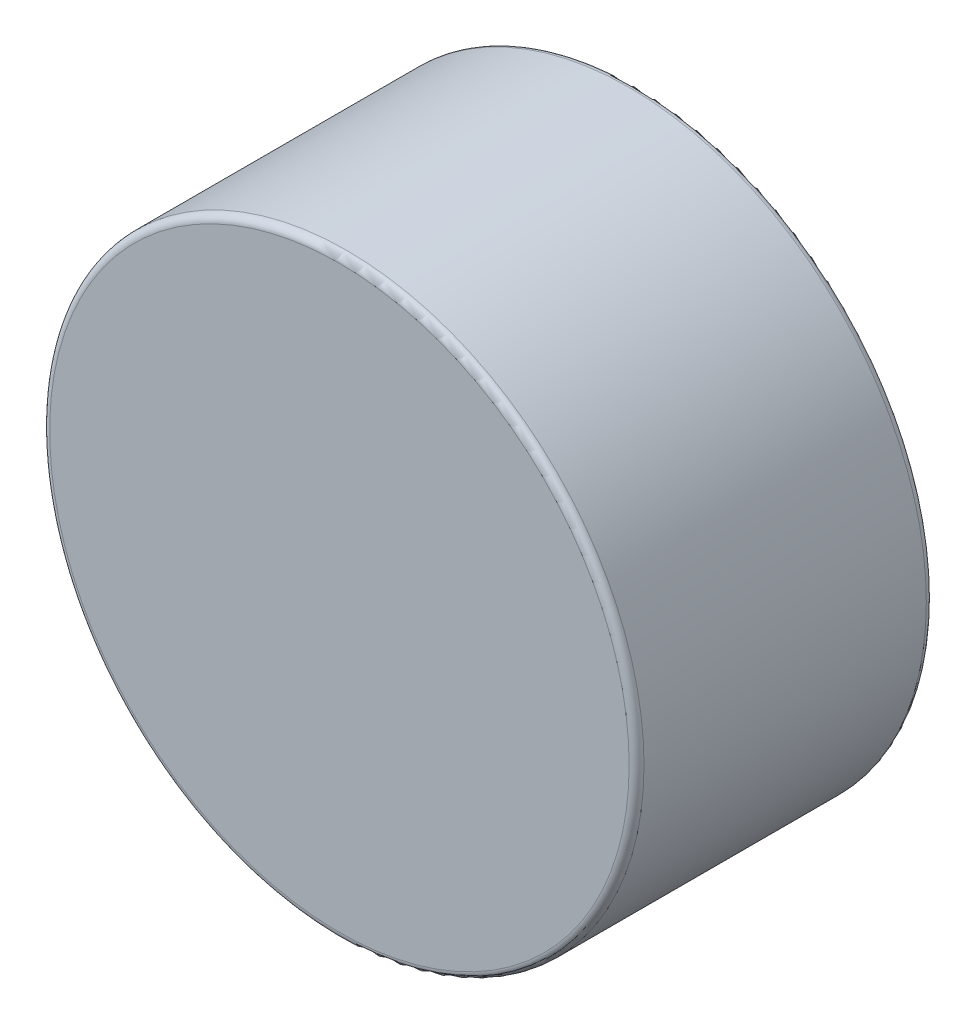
ISO-10303-21;
HEADER;
FILE_DESCRIPTION(('STEP AP214'),'2;1');
FILE_NAME('part.step','',(''),(''),'','','');
FILE_SCHEMA(('AUTOMOTIVE_DESIGN { 1 0 10303 214 1 1 1 1 }'));
ENDSEC;
DATA;
#1=APPLICATION_CONTEXT('core data for automotive mechanical design processes');
#2=APPLICATION_PROTOCOL_DEFINITION('international standard','automotive_design',2000,#1);
#3=PRODUCT_CONTEXT('',#1,'mechanical');
#4=PRODUCT('Part','Part','',(#3));
#5=PRODUCT_RELATED_PRODUCT_CATEGORY('part','',(#4));
#6=PRODUCT_DEFINITION_FORMATION('','',#4);
#7=PRODUCT_DEFINITION_CONTEXT('part definition',#1,'design');
#8=PRODUCT_DEFINITION('design','',#6,#7);
#9=PRODUCT_DEFINITION_SHAPE('','',#8);
#10=(LENGTH_UNIT() NAMED_UNIT(*) SI_UNIT(.MILLI.,.METRE.));
#11=(NAMED_UNIT(*) PLANE_ANGLE_UNIT() SI_UNIT($,.RADIAN.));
#12=(NAMED_UNIT(*) SI_UNIT($,.STERADIAN.) SOLID_ANGLE_UNIT());
#13=UNCERTAINTY_MEASURE_WITH_UNIT(LENGTH_MEASURE(1.E-05),#10,'distance_accuracy_value','');
#14=(GEOMETRIC_REPRESENTATION_CONTEXT(3) GLOBAL_UNCERTAINTY_ASSIGNED_CONTEXT((#13)) GLOBAL_UNIT_ASSIGNED_CONTEXT((#10,
#11,#12)) REPRESENTATION_CONTEXT('',''));
#15=CARTESIAN_POINT('',(0.,0.,0.));
#16=DIRECTION('',(0.,0.,1.));
#17=DIRECTION('',(1.,0.,0.));
#18=AXIS2_PLACEMENT_3D('',#15,#16,#17);
#19=CARTESIAN_POINT('',(0.,0.,4.));
#20=DIRECTION('',(0.,0.,-1.));
#21=DIRECTION('',(-1.,0.,0.));
#22=AXIS2_PLACEMENT_3D('',#19,#20,#21);
#23=CYLINDRICAL_SURFACE('',#22,4.);
#24=CARTESIAN_POINT('',(0.,0.,3.9));
#25=DIRECTION('',(0.,0.,1.));
#26=DIRECTION('',(1.,0.,0.));
#27=AXIS2_PLACEMENT_3D('',#24,#25,#26);
#28=CIRCLE('',#27,4.);
#29=CARTESIAN_POINT('',(4.,0.,3.9));
#30=VERTEX_POINT('',#29);
#31=EDGE_CURVE('E46',#30,#30,#28,.F.);
#32=ORIENTED_EDGE('',*,*,#31,.T.);
#33=EDGE_LOOP('',(#32));
#34=FACE_BOUND('',#33,.T.);
#35=CARTESIAN_POINT('',(0.,0.,0.0999999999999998));
#36=DIRECTION('',(0.,0.,1.));
#37=DIRECTION('',(1.,0.,0.));
#38=AXIS2_PLACEMENT_3D('',#35,#36,#37);
#39=CIRCLE('',#38,4.);
#40=CARTESIAN_POINT('',(4.,0.,0.0999999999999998));
#41=VERTEX_POINT('',#40);
#42=EDGE_CURVE('E52',#41,#41,#39,.T.);
#43=ORIENTED_EDGE('',*,*,#42,.T.);
#44=EDGE_LOOP('',(#43));
#45=FACE_BOUND('',#44,.T.);
#46=ADVANCED_FACE('F39',(#34,#45),#23,.T.);
#47=CARTESIAN_POINT('',(0.,0.,4.));
#48=DIRECTION('',(0.,0.,1.));
#49=DIRECTION('',(1.,0.,0.));
#50=AXIS2_PLACEMENT_3D('',#47,#48,#49);
#51=PLANE('',#50);
#52=CARTESIAN_POINT('',(0.,0.,4.));
#53=DIRECTION('',(0.,0.,1.));
#54=DIRECTION('',(1.,0.,0.));
#55=AXIS2_PLACEMENT_3D('',#52,#53,#54);
#56=CIRCLE('',#55,3.9);
#57=CARTESIAN_POINT('',(3.9,0.,4.));
#58=VERTEX_POINT('',#57);
#59=EDGE_CURVE('E58',#58,#58,#56,.T.);
#60=ORIENTED_EDGE('',*,*,#59,.T.);
#61=EDGE_LOOP('',(#60));
#62=FACE_BOUND('',#61,.T.);
#63=ADVANCED_FACE('F66',(#62),#51,.T.);
#64=CARTESIAN_POINT('',(0.,0.,0.));
#65=DIRECTION('',(0.,0.,1.));
#66=DIRECTION('',(1.,0.,0.));
#67=AXIS2_PLACEMENT_3D('',#64,#65,#66);
#68=PLANE('',#67);
#69=CARTESIAN_POINT('',(0.,0.,0.));
#70=DIRECTION('',(0.,0.,1.));
#71=DIRECTION('',(1.,0.,0.));
#72=AXIS2_PLACEMENT_3D('',#69,#70,#71);
#73=CIRCLE('',#72,3.9);
#74=CARTESIAN_POINT('',(3.9,0.,0.));
#75=VERTEX_POINT('',#74);
#76=EDGE_CURVE('E10',#75,#75,#73,.F.);
#77=ORIENTED_EDGE('',*,*,#76,.T.);
#78=EDGE_LOOP('',(#77));
#79=FACE_BOUND('',#78,.T.);
#80=ADVANCED_FACE('F71',(#79),#68,.F.);
#81=CARTESIAN_POINT('',(0.,0.,3.9));
#82=DIRECTION('',(0.,0.,1.));
#83=DIRECTION('',(1.,0.,0.));
#84=AXIS2_PLACEMENT_3D('',#81,#82,#83);
#85=TOROIDAL_SURFACE('',#84,3.9,0.1);
#86=ORIENTED_EDGE('',*,*,#31,.F.);
#87=EDGE_LOOP('',(#86));
#88=FACE_BOUND('',#87,.T.);
#89=ORIENTED_EDGE('',*,*,#59,.F.);
#90=EDGE_LOOP('',(#89));
#91=FACE_BOUND('',#90,.T.);
#92=ADVANCED_FACE('F68',(#88,#91),#85,.T.);
#93=CARTESIAN_POINT('',(0.,0.,0.0999999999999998));
#94=DIRECTION('',(0.,0.,1.));
#95=DIRECTION('',(1.,0.,0.));
#96=AXIS2_PLACEMENT_3D('',#93,#94,#95);
#97=TOROIDAL_SURFACE('',#96,3.9,0.1);
#98=ORIENTED_EDGE('',*,*,#76,.F.);
#99=EDGE_LOOP('',(#98));
#100=FACE_BOUND('',#99,.T.);
#101=ORIENTED_EDGE('',*,*,#42,.F.);
#102=EDGE_LOOP('',(#101));
#103=FACE_BOUND('',#102,.T.);
#104=ADVANCED_FACE('F70',(#100,#103),#97,.T.);
#105=CLOSED_SHELL('',(#46,#63,#80,#92,#104));
#106=MANIFOLD_SOLID_BREP('B2',#105);
#107=ADVANCED_BREP_SHAPE_REPRESENTATION('',(#18,#106),#14);
#108=SHAPE_DEFINITION_REPRESENTATION(#9,#107);
ENDSEC;
END-ISO-10303-21;
